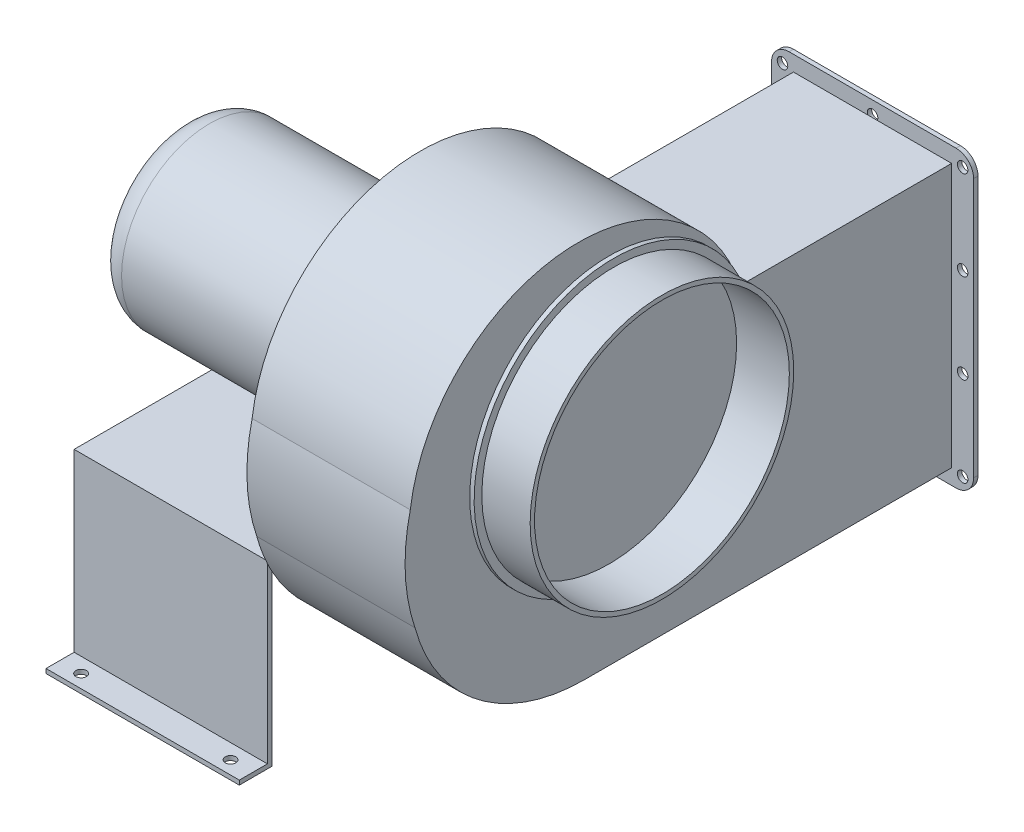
from build123d import *

# Parameters (mm, degrees)
EXTRUDE_1_DEPTH     = 180
SKETCH_2_R          = 150
SKETCH_2_R_2        = 145
EXTRUDE_2_DEPTH     = 60
SKETCH_3_R          = 158.783607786
SKETCH_3_R_2        = 150
EXTRUDE_3_DEPTH     = 5
CUT_EXTRUDE_1_DEPTH = 5.3
EXTRUDE_4_DEPTH     = 5
SKETCH_7_W          = 178
SKETCH_7_H          = 283
CUT_EXTRUDE_4_DEPTH = 350
SKETCH_8_R          = 6
CUT_EXTRUDE_8_DEPTH = 5
SKETCH_9_R          = 100
EXTRUDE_5_DEPTH     = 270
FILLET_1_R          = 30
EXTRUDE_9_DEPTH     = 220
SKETCH_15_R         = 6
CUT_EXTRUDE_9_DEPTH = 5
EXTRUDE_12_DEPTH    = 180
EXTRUDE_13_DEPTH    = 180


with BuildPart() as part:
    # Sketch 1 → Extrude 1 (new body)
    with BuildSketch(Plane(origin=(0, 0, 0), x_dir=(0, 0, -1), z_dir=(1, 0, 0))):
        with BuildLine():
            Line((311.5, -259), (311.5, 41))
            Line((311.5, 41), (65.5, 41))
            Line((65.5, 41), (65.453798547, 41))
            ThreePointArc((65.453798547, 41), (-163.675800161, 170.170980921), (-308.924396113, -49.119604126))
            ThreePointArc((-308.924396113, -49.119604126), (-237.501573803, -198.407119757), (-83.5, -259))
            Line((-83.5, -259), (311.5, -259))
        make_face()
    extrude(amount=EXTRUDE_1_DEPTH)

    # Sketch 2 → Extrude 2 (add)
    with BuildSketch(Plane(origin=(180, 0, 0), x_dir=(0, 0, -1), z_dir=(1, 0, 0))):
        with Locations((-83.5, -14)):
            Circle(SKETCH_2_R)
        with Locations((-83.5, -14)):
            Circle(SKETCH_2_R_2, mode=Mode.SUBTRACT)
    extrude(amount=EXTRUDE_2_DEPTH)

    # Sketch 3 → Extrude 3 (add)
    with BuildSketch(Plane(origin=(180, 0, 0), x_dir=(0, 0, -1), z_dir=(1, 0, 0))):
        with Locations(Location((-83.5, -14, 0), (0, 0, 20.266264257))):
            Circle(SKETCH_3_R)
        with Locations((-83.5, -14)):
            Circle(SKETCH_3_R_2, mode=Mode.SUBTRACT)
    extrude(amount=EXTRUDE_3_DEPTH)

    # Sketch 4 → Cut-Extrude 1 (cut)
    with BuildSketch(Plane(origin=(0, 0, -311.5), x_dir=(-1, 0, 0), z_dir=(0, 0, -1))):
        with BuildLine():
            Line((-185, -276.5), (5, -276.5))
            ThreePointArc((5, -276.5), (19.142135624, -270.642135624), (25, -256.5))
            Line((25, -256.5), (25, 38.5))
            ThreePointArc((25, 38.5), (19.142135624, 52.642135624), (5, 58.5))
            Line((5, 58.5), (-185, 58.5))
            ThreePointArc((-185, 58.5), (-199.142135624, 52.642135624), (-205, 38.5))
            Line((-205, 38.5), (-205, -256.5))
            ThreePointArc((-205, -256.5), (-199.142135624, -270.642135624), (-185, -276.5))
        make_face()
    extrude(amount=-CUT_EXTRUDE_1_DEPTH, mode=Mode.SUBTRACT)

    # Sketch 6 → Extrude 4 (add)
    with BuildSketch(Plane(origin=(0, 0, -306.2), x_dir=(-1, 0, 0), z_dir=(0, 0, -1))):
        with BuildLine():
            Line((-185, -276.5), (5, -276.5))
            ThreePointArc((5, -276.5), (19.142135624, -270.642135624), (25, -256.5))
            Line((25, -256.5), (25, 38.5))
            ThreePointArc((25, 38.5), (19.142135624, 52.642135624), (5, 58.5))
            Line((5, 58.5), (-185, 58.5))
            ThreePointArc((-185, 58.5), (-199.142135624, 52.642135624), (-205, 38.5))
            Line((-205, 38.5), (-205, -256.5))
            ThreePointArc((-205, -256.5), (-199.142135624, -270.642135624), (-185, -276.5))
        make_face()
    extrude(amount=EXTRUDE_4_DEPTH)

    # Sketch 7 → Cut-Extrude 4 (cut)
    with BuildSketch(Plane(origin=(0, 0, -311.2), x_dir=(-1, 0, 0), z_dir=(0, 0, -1))):
        with Locations((-90, -109)):
            Rectangle(SKETCH_7_W, SKETCH_7_H)
    extrude(amount=-CUT_EXTRUDE_4_DEPTH, mode=Mode.SUBTRACT)

    # Sketch 8 → Cut-Extrude 8 (cut)
    with BuildSketch(Plane(origin=(0, 0, -311.2), x_dir=(-1, 0, 0), z_dir=(0, 0, -1))):
        with Locations((-192.5, 43.5)):
            Circle(SKETCH_8_R)
        with Locations((12.5, 43.5)):
            Circle(SKETCH_8_R)
        with Locations((12.5, -261.5)):
            Circle(SKETCH_8_R)
        with Locations((-192.5, -261.5)):
            Circle(SKETCH_8_R)
        with Locations((-192.5, -58.1)):
            Circle(SKETCH_8_R)
        with Locations((-192.5, -159.9)):
            Circle(SKETCH_8_R)
        with Locations((12.5, -159.9)):
            Circle(SKETCH_8_R)
        with Locations((12.5, -58.1)):
            Circle(SKETCH_8_R)
        with Locations((-90, 43.5)):
            Circle(SKETCH_8_R)
        with Locations((-90, -261.5)):
            Circle(SKETCH_8_R)
    extrude(amount=-CUT_EXTRUDE_8_DEPTH, mode=Mode.SUBTRACT)

    # Sketch 9 → Extrude 5 (add)
    with BuildSketch(Plane.ZY):
        with Locations(Location((118.5, -17.5, 0), (0, 0, 180))):
            Circle(SKETCH_9_R)
    extrude(amount=EXTRUDE_5_DEPTH)

    # Fillet 1
    fillet_1_edges = [part.edges().sort_by_distance(p)[0] for p in [
        (-270, -17.5, 218.5),
    ]]
    fillet(fillet_1_edges, radius=FILLET_1_R)

    # Sketch 11 → Extrude 9 (add)
    with BuildSketch(Plane.ZY):
        Polygon((-55.5, -141.5), (292.5, -141.5), (292.5, -341.5), (324.5, -341.5), (324.5, -346.5), (292.5, -346.5), (287.5, -346.5), (287.5, -146.5), (-50.5, -146.5), (-50.5, -346.5), (-87.5, -346.5), (-87.5, -341.5), (-55.5, -341.5), align=None)
    extrude(amount=EXTRUDE_9_DEPTH)

    # Sketch 15 → Cut-Extrude 9 (cut)
    with BuildSketch(Plane(origin=(0, -341.5, 0), x_dir=(1, 0, 0), z_dir=(0, 1, 0))):
        with Locations(Location((-195, 72.5, 0), (0, 0, 270))):
            Circle(SKETCH_15_R)
        with Locations(Location((-25, 72.5, 0), (0, 0, 270))):
            Circle(SKETCH_15_R)
        with Locations(Location((-195, -309.5, 0), (0, 0, 270))):
            Circle(SKETCH_15_R)
        with Locations(Location((-25, -309.5, 0), (0, 0, 270))):
            Circle(SKETCH_15_R)
    extrude(amount=-CUT_EXTRUDE_9_DEPTH, mode=Mode.SUBTRACT)

    # Sketch 16 → Extrude 12 (add)
    with BuildSketch(Plane.ZY):
        with BuildLine():
            Line((83.5, -259), (111.531733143, -259))
            ThreePointArc((111.531733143, -259), (252.95308938, -200.421356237), (311.531733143, -59))
            Line((311.531733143, -59), (311.531733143, -17.5))
            ThreePointArc((311.531733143, -17.5), (310.878794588, -33.363460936), (308.924396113, -49.119604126))
            ThreePointArc((308.924396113, -49.119604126), (237.501573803, -198.407119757), (83.5, -259))
        make_face()
    extrude(amount=-EXTRUDE_12_DEPTH)

    # Sketch 18 → Extrude 13 (add)
    with BuildSketch(Plane.ZY):
        with BuildLine():
            Line((309.558740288, 8.946307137), (311.531733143, -17.5))
            Line((311.531733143, -17.5), (311.531733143, -59))
            Line((311.531733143, -59), (309.558740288, -87.023283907))
            Line((309.558740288, -87.023283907), (304.562042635, -111.338318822))
            ThreePointArc((304.562042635, -111.338318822), (315.661555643, -51.553303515), (309.558740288, 8.946307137))
        make_face()
    extrude(amount=-EXTRUDE_13_DEPTH)


solid = part.part
